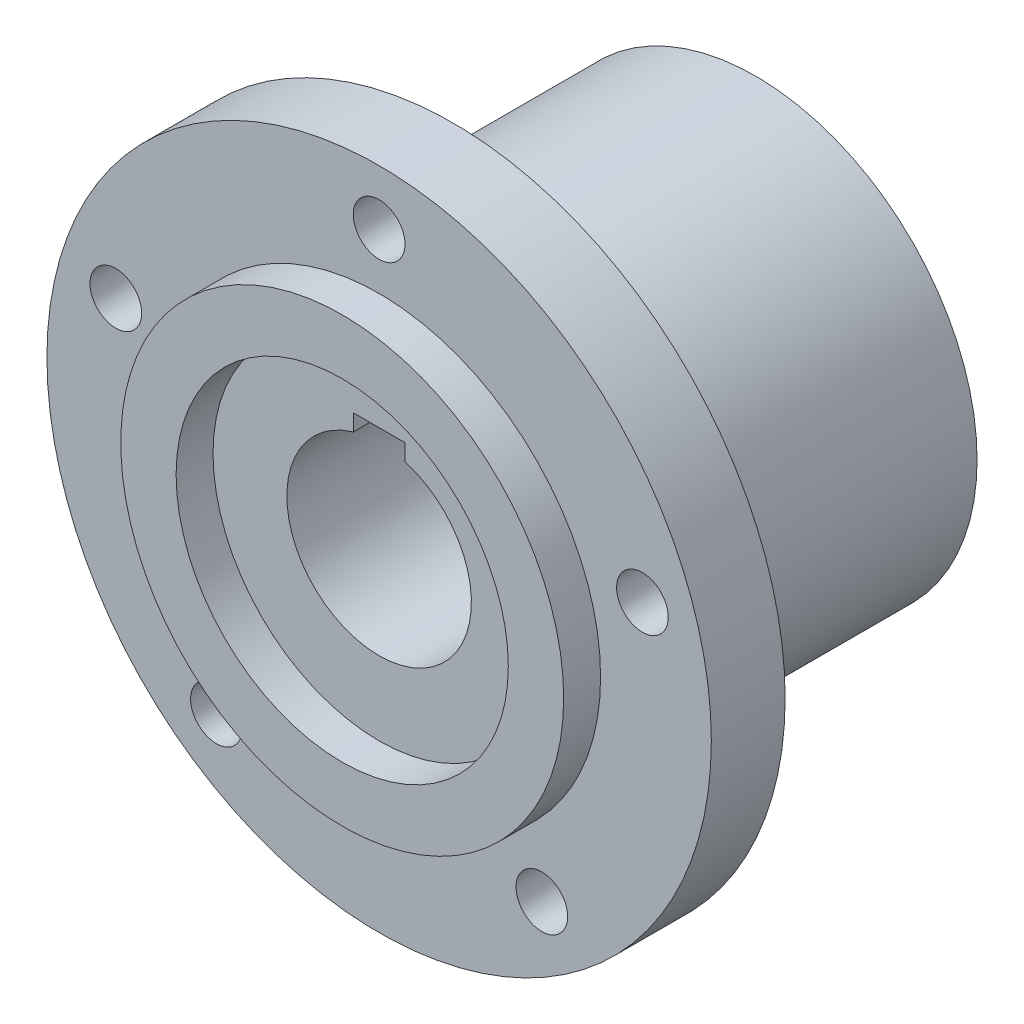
ISO-10303-21;
HEADER;
FILE_DESCRIPTION(('STEP AP214'),'2;1');
FILE_NAME('part.step','',(''),(''),'','','');
FILE_SCHEMA(('AUTOMOTIVE_DESIGN { 1 0 10303 214 1 1 1 1 }'));
ENDSEC;
DATA;
#1=APPLICATION_CONTEXT('core data for automotive mechanical design processes');
#2=APPLICATION_PROTOCOL_DEFINITION('international standard','automotive_design',2000,#1);
#3=PRODUCT_CONTEXT('',#1,'mechanical');
#4=PRODUCT('Part','Part','',(#3));
#5=PRODUCT_RELATED_PRODUCT_CATEGORY('part','',(#4));
#6=PRODUCT_DEFINITION_FORMATION('','',#4);
#7=PRODUCT_DEFINITION_CONTEXT('part definition',#1,'design');
#8=PRODUCT_DEFINITION('design','',#6,#7);
#9=PRODUCT_DEFINITION_SHAPE('','',#8);
#10=(LENGTH_UNIT() NAMED_UNIT(*) SI_UNIT(.MILLI.,.METRE.));
#11=(NAMED_UNIT(*) PLANE_ANGLE_UNIT() SI_UNIT($,.RADIAN.));
#12=(NAMED_UNIT(*) SI_UNIT($,.STERADIAN.) SOLID_ANGLE_UNIT());
#13=UNCERTAINTY_MEASURE_WITH_UNIT(LENGTH_MEASURE(1.E-05),#10,'distance_accuracy_value','');
#14=(GEOMETRIC_REPRESENTATION_CONTEXT(3) GLOBAL_UNCERTAINTY_ASSIGNED_CONTEXT((#13)) GLOBAL_UNIT_ASSIGNED_CONTEXT((#10,
#11,#12)) REPRESENTATION_CONTEXT('',''));
#15=CARTESIAN_POINT('',(0.,0.,0.));
#16=DIRECTION('',(0.,0.,1.));
#17=DIRECTION('',(1.,0.,0.));
#18=AXIS2_PLACEMENT_3D('',#15,#16,#17);
#19=CARTESIAN_POINT('',(0.,0.,51.));
#20=DIRECTION('',(0.,0.,1.));
#21=DIRECTION('',(1.,0.,0.));
#22=AXIS2_PLACEMENT_3D('',#19,#20,#21);
#23=PLANE('',#22);
#24=CARTESIAN_POINT('',(-71.3292387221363,23.1762745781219,51.));
#25=DIRECTION('',(0.,0.,1.));
#26=DIRECTION('',(1.,0.,0.));
#27=AXIS2_PLACEMENT_3D('',#24,#25,#26);
#28=CIRCLE('',#27,6.99999999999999);
#29=CARTESIAN_POINT('',(-64.3292387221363,23.1762745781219,51.));
#30=VERTEX_POINT('',#29);
#31=EDGE_CURVE('E133',#30,#30,#28,.T.);
#32=ORIENTED_EDGE('',*,*,#31,.F.);
#33=EDGE_LOOP('',(#32));
#34=FACE_BOUND('',#33,.T.);
#35=CARTESIAN_POINT('',(-44.0838939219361,-60.6762745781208,51.));
#36=DIRECTION('',(0.,0.,1.));
#37=DIRECTION('',(1.,0.,0.));
#38=AXIS2_PLACEMENT_3D('',#35,#36,#37);
#39=CIRCLE('',#38,6.99999999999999);
#40=CARTESIAN_POINT('',(-37.0838939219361,-60.6762745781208,51.));
#41=VERTEX_POINT('',#40);
#42=EDGE_CURVE('E130',#41,#41,#39,.T.);
#43=ORIENTED_EDGE('',*,*,#42,.F.);
#44=EDGE_LOOP('',(#43));
#45=FACE_BOUND('',#44,.T.);
#46=CARTESIAN_POINT('',(44.0838939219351,-60.6762745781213,51.));
#47=DIRECTION('',(0.,0.,1.));
#48=DIRECTION('',(1.,0.,0.));
#49=AXIS2_PLACEMENT_3D('',#46,#47,#48);
#50=CIRCLE('',#49,6.99999999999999);
#51=CARTESIAN_POINT('',(51.0838939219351,-60.6762745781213,51.));
#52=VERTEX_POINT('',#51);
#53=EDGE_CURVE('E127',#52,#52,#50,.T.);
#54=ORIENTED_EDGE('',*,*,#53,.F.);
#55=EDGE_LOOP('',(#54));
#56=FACE_BOUND('',#55,.T.);
#57=CARTESIAN_POINT('',(71.3292387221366,23.1762745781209,51.0000000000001));
#58=DIRECTION('',(0.,0.,1.));
#59=DIRECTION('',(1.,0.,0.));
#60=AXIS2_PLACEMENT_3D('',#57,#58,#59);
#61=CIRCLE('',#60,6.99999999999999);
#62=CARTESIAN_POINT('',(78.3292387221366,23.1762745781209,51.0000000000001));
#63=VERTEX_POINT('',#62);
#64=EDGE_CURVE('E123',#63,#63,#61,.T.);
#65=ORIENTED_EDGE('',*,*,#64,.F.);
#66=EDGE_LOOP('',(#65));
#67=FACE_BOUND('',#66,.T.);
#68=CARTESIAN_POINT('',(0.,75.0000000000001,51.));
#69=DIRECTION('',(0.,0.,1.));
#70=DIRECTION('',(1.,0.,0.));
#71=AXIS2_PLACEMENT_3D('',#68,#69,#70);
#72=CIRCLE('',#71,6.99999999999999);
#73=CARTESIAN_POINT('',(6.99999999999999,75.0000000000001,51.));
#74=VERTEX_POINT('',#73);
#75=EDGE_CURVE('E119',#74,#74,#72,.T.);
#76=ORIENTED_EDGE('',*,*,#75,.F.);
#77=EDGE_LOOP('',(#76));
#78=FACE_BOUND('',#77,.T.);
#79=CARTESIAN_POINT('',(0.,0.,51.));
#80=DIRECTION('',(0.,0.,1.));
#81=DIRECTION('',(1.,0.,0.));
#82=AXIS2_PLACEMENT_3D('',#79,#80,#81);
#83=CIRCLE('',#82,90.);
#84=CARTESIAN_POINT('',(90.0000000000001,0.,51.));
#85=VERTEX_POINT('',#84);
#86=EDGE_CURVE('E118',#85,#85,#83,.T.);
#87=ORIENTED_EDGE('',*,*,#86,.T.);
#88=EDGE_LOOP('',(#87));
#89=FACE_BOUND('',#88,.T.);
#90=CARTESIAN_POINT('',(0.,0.,51.));
#91=DIRECTION('',(0.,0.,1.));
#92=DIRECTION('',(1.,0.,0.));
#93=AXIS2_PLACEMENT_3D('',#90,#91,#92);
#94=CIRCLE('',#93,60.);
#95=CARTESIAN_POINT('',(60.,0.,51.));
#96=VERTEX_POINT('',#95);
#97=EDGE_CURVE('E144',#96,#96,#94,.T.);
#98=ORIENTED_EDGE('',*,*,#97,.F.);
#99=EDGE_LOOP('',(#98));
#100=FACE_BOUND('',#99,.T.);
#101=ADVANCED_FACE('F34',(#34,#45,#56,#67,#78,#89,#100),#23,.T.);
#102=CARTESIAN_POINT('',(0.,0.,51.));
#103=DIRECTION('',(0.,0.,-1.));
#104=DIRECTION('',(-1.,0.,0.));
#105=AXIS2_PLACEMENT_3D('',#102,#103,#104);
#106=CYLINDRICAL_SURFACE('',#105,60.);
#107=CARTESIAN_POINT('',(0.,0.,-51.));
#108=DIRECTION('',(0.,0.,1.));
#109=DIRECTION('',(1.,0.,0.));
#110=AXIS2_PLACEMENT_3D('',#107,#108,#109);
#111=CIRCLE('',#110,60.);
#112=CARTESIAN_POINT('',(60.0000000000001,0.,-51.));
#113=VERTEX_POINT('',#112);
#114=EDGE_CURVE('E108',#113,#113,#111,.T.);
#115=ORIENTED_EDGE('',*,*,#114,.T.);
#116=EDGE_LOOP('',(#115));
#117=FACE_BOUND('',#116,.T.);
#118=CARTESIAN_POINT('',(0.,0.,31.));
#119=DIRECTION('',(0.,0.,1.));
#120=DIRECTION('',(1.,0.,0.));
#121=AXIS2_PLACEMENT_3D('',#118,#119,#120);
#122=CIRCLE('',#121,60.);
#123=CARTESIAN_POINT('',(60.,0.,31.));
#124=VERTEX_POINT('',#123);
#125=EDGE_CURVE('E42',#124,#124,#122,.T.);
#126=ORIENTED_EDGE('',*,*,#125,.F.);
#127=EDGE_LOOP('',(#126));
#128=FACE_BOUND('',#127,.T.);
#129=ADVANCED_FACE('F36',(#117,#128),#106,.T.);
#130=CARTESIAN_POINT('',(0.,0.,51.));
#131=DIRECTION('',(0.,0.,1.));
#132=DIRECTION('',(1.,0.,0.));
#133=AXIS2_PLACEMENT_3D('',#130,#131,#132);
#134=CIRCLE('',#133,45.);
#135=CARTESIAN_POINT('',(45.,0.,51.));
#136=VERTEX_POINT('',#135);
#137=EDGE_CURVE('E12',#136,#136,#134,.F.);
#138=ORIENTED_EDGE('',*,*,#137,.F.);
#139=EDGE_LOOP('',(#138));
#140=FACE_BOUND('',#139,.T.);
#141=DIRECTION('',(0.,1.,0.));
#142=VECTOR('',#141,1.);
#143=CARTESIAN_POINT('',(7.00000000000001,28.5,51.));
#144=LINE('',#143,#142);
#145=CARTESIAN_POINT('',(7.00000000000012,24.,51.));
#146=VERTEX_POINT('',#145);
#147=CARTESIAN_POINT('',(7.00000000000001,28.5,51.));
#148=VERTEX_POINT('',#147);
#149=EDGE_CURVE('E49',#146,#148,#144,.T.);
#150=ORIENTED_EDGE('',*,*,#149,.F.);
#151=CARTESIAN_POINT('',(0.,0.,51.));
#152=DIRECTION('',(0.,0.,1.));
#153=DIRECTION('',(1.,0.,0.));
#154=AXIS2_PLACEMENT_3D('',#151,#152,#153);
#155=CIRCLE('',#154,25.);
#156=CARTESIAN_POINT('',(-6.9999999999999,24.,51.));
#157=VERTEX_POINT('',#156);
#158=EDGE_CURVE('E92',#157,#146,#155,.T.);
#159=ORIENTED_EDGE('',*,*,#158,.F.);
#160=DIRECTION('',(0.,-1.,0.));
#161=VECTOR('',#160,1.);
#162=CARTESIAN_POINT('',(-7.00000000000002,28.5000000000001,51.));
#163=LINE('',#162,#161);
#164=CARTESIAN_POINT('',(-7.00000000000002,28.5000000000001,51.));
#165=VERTEX_POINT('',#164);
#166=EDGE_CURVE('E77',#165,#157,#163,.T.);
#167=ORIENTED_EDGE('',*,*,#166,.F.);
#168=DIRECTION('',(-1.,0.,0.));
#169=VECTOR('',#168,1.);
#170=CARTESIAN_POINT('',(7.00000000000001,28.5,51.));
#171=LINE('',#170,#169);
#172=EDGE_CURVE('E86',#148,#165,#171,.T.);
#173=ORIENTED_EDGE('',*,*,#172,.F.);
#174=EDGE_LOOP('',(#150,#159,#167,#173));
#175=FACE_BOUND('',#174,.T.);
#176=ADVANCED_FACE('F90',(#140,#175),#23,.T.);
#177=CARTESIAN_POINT('',(0.,0.,-51.));
#178=DIRECTION('',(0.,0.,1.));
#179=DIRECTION('',(1.,0.,0.));
#180=AXIS2_PLACEMENT_3D('',#177,#178,#179);
#181=PLANE('',#180);
#182=CARTESIAN_POINT('',(0.,0.,-51.));
#183=DIRECTION('',(0.,0.,1.));
#184=DIRECTION('',(1.,0.,0.));
#185=AXIS2_PLACEMENT_3D('',#182,#183,#184);
#186=CIRCLE('',#185,25.);
#187=CARTESIAN_POINT('',(-6.99999999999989,24.0000000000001,-51.));
#188=VERTEX_POINT('',#187);
#189=CARTESIAN_POINT('',(7.00000000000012,24.,-51.));
#190=VERTEX_POINT('',#189);
#191=EDGE_CURVE('E103',#188,#190,#186,.T.);
#192=ORIENTED_EDGE('',*,*,#191,.T.);
#193=DIRECTION('',(0.,1.,0.));
#194=VECTOR('',#193,1.);
#195=CARTESIAN_POINT('',(7.00000000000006,28.5,-51.));
#196=LINE('',#195,#194);
#197=CARTESIAN_POINT('',(7.00000000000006,28.5,-51.));
#198=VERTEX_POINT('',#197);
#199=EDGE_CURVE('E94',#190,#198,#196,.T.);
#200=ORIENTED_EDGE('',*,*,#199,.T.);
#201=DIRECTION('',(-1.,0.,0.));
#202=VECTOR('',#201,1.);
#203=CARTESIAN_POINT('',(7.00000000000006,28.5,-51.));
#204=LINE('',#203,#202);
#205=CARTESIAN_POINT('',(-6.99999999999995,28.5000000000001,-51.));
#206=VERTEX_POINT('',#205);
#207=EDGE_CURVE('E100',#198,#206,#204,.T.);
#208=ORIENTED_EDGE('',*,*,#207,.T.);
#209=DIRECTION('',(0.,-1.,0.));
#210=VECTOR('',#209,1.);
#211=CARTESIAN_POINT('',(-6.99999999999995,28.5000000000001,-51.));
#212=LINE('',#211,#210);
#213=EDGE_CURVE('E57',#206,#188,#212,.T.);
#214=ORIENTED_EDGE('',*,*,#213,.T.);
#215=EDGE_LOOP('',(#192,#200,#208,#214));
#216=FACE_BOUND('',#215,.T.);
#217=ORIENTED_EDGE('',*,*,#114,.F.);
#218=EDGE_LOOP('',(#217));
#219=FACE_BOUND('',#218,.T.);
#220=ADVANCED_FACE('F185',(#216,#219),#181,.F.);
#221=CARTESIAN_POINT('',(7.00000000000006,28.5,-51.));
#222=DIRECTION('',(1.,0.,0.));
#223=DIRECTION('',(0.,1.,0.));
#224=AXIS2_PLACEMENT_3D('',#221,#222,#223);
#225=PLANE('',#224);
#226=ORIENTED_EDGE('',*,*,#149,.T.);
#227=DIRECTION('',(0.,0.,1.));
#228=VECTOR('',#227,1.);
#229=CARTESIAN_POINT('',(7.00000000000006,28.5,-51.));
#230=LINE('',#229,#228);
#231=EDGE_CURVE('E83',#198,#148,#230,.T.);
#232=ORIENTED_EDGE('',*,*,#231,.F.);
#233=ORIENTED_EDGE('',*,*,#199,.F.);
#234=DIRECTION('',(0.,0.,1.));
#235=VECTOR('',#234,1.);
#236=CARTESIAN_POINT('',(7.00000000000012,24.,-51.));
#237=LINE('',#236,#235);
#238=EDGE_CURVE('E106',#190,#146,#237,.T.);
#239=ORIENTED_EDGE('',*,*,#238,.T.);
#240=EDGE_LOOP('',(#226,#232,#233,#239));
#241=FACE_BOUND('',#240,.T.);
#242=ADVANCED_FACE('F190',(#241),#225,.F.);
#243=CARTESIAN_POINT('',(0.,0.,-51.));
#244=DIRECTION('',(0.,0.,1.));
#245=DIRECTION('',(1.,0.,0.));
#246=AXIS2_PLACEMENT_3D('',#243,#244,#245);
#247=CYLINDRICAL_SURFACE('',#246,25.);
#248=ORIENTED_EDGE('',*,*,#158,.T.);
#249=ORIENTED_EDGE('',*,*,#238,.F.);
#250=ORIENTED_EDGE('',*,*,#191,.F.);
#251=DIRECTION('',(0.,0.,1.));
#252=VECTOR('',#251,1.);
#253=CARTESIAN_POINT('',(-6.99999999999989,24.0000000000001,-51.));
#254=LINE('',#253,#252);
#255=EDGE_CURVE('E82',#188,#157,#254,.T.);
#256=ORIENTED_EDGE('',*,*,#255,.T.);
#257=EDGE_LOOP('',(#248,#249,#250,#256));
#258=FACE_BOUND('',#257,.T.);
#259=ADVANCED_FACE('F308',(#258),#247,.F.);
#260=CARTESIAN_POINT('',(-6.99999999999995,28.5000000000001,-51.));
#261=DIRECTION('',(-1.,0.,0.));
#262=DIRECTION('',(0.,-1.,0.));
#263=AXIS2_PLACEMENT_3D('',#260,#261,#262);
#264=PLANE('',#263);
#265=ORIENTED_EDGE('',*,*,#166,.T.);
#266=ORIENTED_EDGE('',*,*,#255,.F.);
#267=ORIENTED_EDGE('',*,*,#213,.F.);
#268=DIRECTION('',(0.,0.,1.));
#269=VECTOR('',#268,1.);
#270=CARTESIAN_POINT('',(-6.99999999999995,28.5000000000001,-51.));
#271=LINE('',#270,#269);
#272=EDGE_CURVE('E73',#206,#165,#271,.T.);
#273=ORIENTED_EDGE('',*,*,#272,.T.);
#274=EDGE_LOOP('',(#265,#266,#267,#273));
#275=FACE_BOUND('',#274,.T.);
#276=ADVANCED_FACE('F75',(#275),#264,.F.);
#277=CARTESIAN_POINT('',(7.00000000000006,28.5,-51.));
#278=DIRECTION('',(0.,1.,0.));
#279=DIRECTION('',(0.,0.,1.));
#280=AXIS2_PLACEMENT_3D('',#277,#278,#279);
#281=PLANE('',#280);
#282=ORIENTED_EDGE('',*,*,#172,.T.);
#283=ORIENTED_EDGE('',*,*,#272,.F.);
#284=ORIENTED_EDGE('',*,*,#207,.F.);
#285=ORIENTED_EDGE('',*,*,#231,.T.);
#286=EDGE_LOOP('',(#282,#283,#284,#285));
#287=FACE_BOUND('',#286,.T.);
#288=ADVANCED_FACE('F87',(#287),#281,.F.);
#289=CARTESIAN_POINT('',(0.,0.,31.));
#290=DIRECTION('',(0.,0.,1.));
#291=DIRECTION('',(1.,0.,0.));
#292=AXIS2_PLACEMENT_3D('',#289,#290,#291);
#293=CYLINDRICAL_SURFACE('',#292,90.);
#294=CARTESIAN_POINT('',(0.,0.,31.));
#295=DIRECTION('',(0.,0.,1.));
#296=DIRECTION('',(1.,0.,0.));
#297=AXIS2_PLACEMENT_3D('',#294,#295,#296);
#298=CIRCLE('',#297,90.);
#299=CARTESIAN_POINT('',(90.0000000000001,0.,31.));
#300=VERTEX_POINT('',#299);
#301=EDGE_CURVE('E156',#300,#300,#298,.T.);
#302=ORIENTED_EDGE('',*,*,#301,.T.);
#303=EDGE_LOOP('',(#302));
#304=FACE_BOUND('',#303,.T.);
#305=ORIENTED_EDGE('',*,*,#86,.F.);
#306=EDGE_LOOP('',(#305));
#307=FACE_BOUND('',#306,.T.);
#308=ADVANCED_FACE('F160',(#304,#307),#293,.T.);
#309=CARTESIAN_POINT('',(0.,0.,31.));
#310=DIRECTION('',(0.,0.,1.));
#311=DIRECTION('',(1.,0.,0.));
#312=AXIS2_PLACEMENT_3D('',#309,#310,#311);
#313=PLANE('',#312);
#314=CARTESIAN_POINT('',(-71.3292387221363,23.1762745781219,31.));
#315=DIRECTION('',(0.,0.,1.));
#316=DIRECTION('',(1.,0.,0.));
#317=AXIS2_PLACEMENT_3D('',#314,#315,#316);
#318=CIRCLE('',#317,6.99999999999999);
#319=CARTESIAN_POINT('',(-64.3292387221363,23.1762745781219,31.));
#320=VERTEX_POINT('',#319);
#321=EDGE_CURVE('E131',#320,#320,#318,.T.);
#322=ORIENTED_EDGE('',*,*,#321,.T.);
#323=EDGE_LOOP('',(#322));
#324=FACE_BOUND('',#323,.T.);
#325=CARTESIAN_POINT('',(-44.0838939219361,-60.6762745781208,31.0000000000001));
#326=DIRECTION('',(0.,0.,1.));
#327=DIRECTION('',(1.,0.,0.));
#328=AXIS2_PLACEMENT_3D('',#325,#326,#327);
#329=CIRCLE('',#328,6.99999999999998);
#330=CARTESIAN_POINT('',(-37.0838939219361,-60.6762745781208,31.0000000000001));
#331=VERTEX_POINT('',#330);
#332=EDGE_CURVE('E128',#331,#331,#329,.T.);
#333=ORIENTED_EDGE('',*,*,#332,.T.);
#334=EDGE_LOOP('',(#333));
#335=FACE_BOUND('',#334,.T.);
#336=CARTESIAN_POINT('',(44.0838939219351,-60.6762745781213,31.));
#337=DIRECTION('',(0.,0.,1.));
#338=DIRECTION('',(1.,0.,0.));
#339=AXIS2_PLACEMENT_3D('',#336,#337,#338);
#340=CIRCLE('',#339,6.99999999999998);
#341=CARTESIAN_POINT('',(51.0838939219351,-60.6762745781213,31.));
#342=VERTEX_POINT('',#341);
#343=EDGE_CURVE('E124',#342,#342,#340,.T.);
#344=ORIENTED_EDGE('',*,*,#343,.T.);
#345=EDGE_LOOP('',(#344));
#346=FACE_BOUND('',#345,.T.);
#347=CARTESIAN_POINT('',(71.3292387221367,23.1762745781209,31.));
#348=DIRECTION('',(0.,0.,1.));
#349=DIRECTION('',(1.,0.,0.));
#350=AXIS2_PLACEMENT_3D('',#347,#348,#349);
#351=CIRCLE('',#350,6.99999999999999);
#352=CARTESIAN_POINT('',(78.3292387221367,23.1762745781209,31.));
#353=VERTEX_POINT('',#352);
#354=EDGE_CURVE('E120',#353,#353,#351,.T.);
#355=ORIENTED_EDGE('',*,*,#354,.T.);
#356=EDGE_LOOP('',(#355));
#357=FACE_BOUND('',#356,.T.);
#358=CARTESIAN_POINT('',(0.,75.0000000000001,31.));
#359=DIRECTION('',(0.,0.,1.));
#360=DIRECTION('',(1.,0.,0.));
#361=AXIS2_PLACEMENT_3D('',#358,#359,#360);
#362=CIRCLE('',#361,6.99999999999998);
#363=CARTESIAN_POINT('',(6.99999999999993,75.0000000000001,31.));
#364=VERTEX_POINT('',#363);
#365=EDGE_CURVE('E115',#364,#364,#362,.T.);
#366=ORIENTED_EDGE('',*,*,#365,.T.);
#367=EDGE_LOOP('',(#366));
#368=FACE_BOUND('',#367,.T.);
#369=ORIENTED_EDGE('',*,*,#125,.T.);
#370=EDGE_LOOP('',(#369));
#371=FACE_BOUND('',#370,.T.);
#372=ORIENTED_EDGE('',*,*,#301,.F.);
#373=EDGE_LOOP('',(#372));
#374=FACE_BOUND('',#373,.T.);
#375=ADVANCED_FACE('F163',(#324,#335,#346,#357,#368,#371,#374),#313,.F.);
#376=CARTESIAN_POINT('',(0.,75.0000000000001,51.));
#377=DIRECTION('',(0.,0.,1.));
#378=DIRECTION('',(1.,0.,0.));
#379=AXIS2_PLACEMENT_3D('',#376,#377,#378);
#380=CYLINDRICAL_SURFACE('',#379,6.99999999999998);
#381=ORIENTED_EDGE('',*,*,#75,.T.);
#382=EDGE_LOOP('',(#381));
#383=FACE_BOUND('',#382,.T.);
#384=ORIENTED_EDGE('',*,*,#365,.F.);
#385=EDGE_LOOP('',(#384));
#386=FACE_BOUND('',#385,.T.);
#387=ADVANCED_FACE('F165',(#383,#386),#380,.F.);
#388=CARTESIAN_POINT('',(71.3292387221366,23.1762745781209,51.0000000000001));
#389=DIRECTION('',(0.,0.,1.));
#390=DIRECTION('',(1.,0.,0.));
#391=AXIS2_PLACEMENT_3D('',#388,#389,#390);
#392=CYLINDRICAL_SURFACE('',#391,6.99999999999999);
#393=ORIENTED_EDGE('',*,*,#64,.T.);
#394=EDGE_LOOP('',(#393));
#395=FACE_BOUND('',#394,.T.);
#396=ORIENTED_EDGE('',*,*,#354,.F.);
#397=EDGE_LOOP('',(#396));
#398=FACE_BOUND('',#397,.T.);
#399=ADVANCED_FACE('F171',(#395,#398),#392,.F.);
#400=CARTESIAN_POINT('',(44.0838939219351,-60.6762745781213,51.));
#401=DIRECTION('',(0.,0.,1.));
#402=DIRECTION('',(1.,0.,0.));
#403=AXIS2_PLACEMENT_3D('',#400,#401,#402);
#404=CYLINDRICAL_SURFACE('',#403,6.99999999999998);
#405=ORIENTED_EDGE('',*,*,#53,.T.);
#406=EDGE_LOOP('',(#405));
#407=FACE_BOUND('',#406,.T.);
#408=ORIENTED_EDGE('',*,*,#343,.F.);
#409=EDGE_LOOP('',(#408));
#410=FACE_BOUND('',#409,.T.);
#411=ADVANCED_FACE('F216',(#407,#410),#404,.F.);
#412=CARTESIAN_POINT('',(-44.0838939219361,-60.6762745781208,51.));
#413=DIRECTION('',(0.,0.,1.));
#414=DIRECTION('',(1.,0.,0.));
#415=AXIS2_PLACEMENT_3D('',#412,#413,#414);
#416=CYLINDRICAL_SURFACE('',#415,6.99999999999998);
#417=ORIENTED_EDGE('',*,*,#42,.T.);
#418=EDGE_LOOP('',(#417));
#419=FACE_BOUND('',#418,.T.);
#420=ORIENTED_EDGE('',*,*,#332,.F.);
#421=EDGE_LOOP('',(#420));
#422=FACE_BOUND('',#421,.T.);
#423=ADVANCED_FACE('F213',(#419,#422),#416,.F.);
#424=CARTESIAN_POINT('',(-71.3292387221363,23.1762745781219,51.));
#425=DIRECTION('',(0.,0.,1.));
#426=DIRECTION('',(1.,0.,0.));
#427=AXIS2_PLACEMENT_3D('',#424,#425,#426);
#428=CYLINDRICAL_SURFACE('',#427,6.99999999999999);
#429=ORIENTED_EDGE('',*,*,#31,.T.);
#430=EDGE_LOOP('',(#429));
#431=FACE_BOUND('',#430,.T.);
#432=ORIENTED_EDGE('',*,*,#321,.F.);
#433=EDGE_LOOP('',(#432));
#434=FACE_BOUND('',#433,.T.);
#435=ADVANCED_FACE('F208',(#431,#434),#428,.F.);
#436=CARTESIAN_POINT('',(0.,0.,61.0000000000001));
#437=DIRECTION('',(0.,0.,1.));
#438=DIRECTION('',(1.,0.,0.));
#439=AXIS2_PLACEMENT_3D('',#436,#437,#438);
#440=PLANE('',#439);
#441=CARTESIAN_POINT('',(0.,0.,61.0000000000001));
#442=DIRECTION('',(0.,0.,1.));
#443=DIRECTION('',(1.,0.,0.));
#444=AXIS2_PLACEMENT_3D('',#441,#442,#443);
#445=CIRCLE('',#444,60.);
#446=CARTESIAN_POINT('',(60.,0.,61.0000000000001));
#447=VERTEX_POINT('',#446);
#448=EDGE_CURVE('E139',#447,#447,#445,.T.);
#449=ORIENTED_EDGE('',*,*,#448,.T.);
#450=EDGE_LOOP('',(#449));
#451=FACE_BOUND('',#450,.T.);
#452=CARTESIAN_POINT('',(0.,0.,61.0000000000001));
#453=DIRECTION('',(0.,0.,1.));
#454=DIRECTION('',(1.,0.,0.));
#455=AXIS2_PLACEMENT_3D('',#452,#453,#454);
#456=CIRCLE('',#455,45.);
#457=CARTESIAN_POINT('',(45.,0.,61.0000000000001));
#458=VERTEX_POINT('',#457);
#459=EDGE_CURVE('E244',#458,#458,#456,.T.);
#460=ORIENTED_EDGE('',*,*,#459,.F.);
#461=EDGE_LOOP('',(#460));
#462=FACE_BOUND('',#461,.T.);
#463=ADVANCED_FACE('F202',(#451,#462),#440,.T.);
#464=CARTESIAN_POINT('',(0.,0.,61.0000000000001));
#465=DIRECTION('',(0.,0.,-1.));
#466=DIRECTION('',(-1.,0.,0.));
#467=AXIS2_PLACEMENT_3D('',#464,#465,#466);
#468=CYLINDRICAL_SURFACE('',#467,60.);
#469=ORIENTED_EDGE('',*,*,#448,.F.);
#470=EDGE_LOOP('',(#469));
#471=FACE_BOUND('',#470,.T.);
#472=ORIENTED_EDGE('',*,*,#97,.T.);
#473=EDGE_LOOP('',(#472));
#474=FACE_BOUND('',#473,.T.);
#475=ADVANCED_FACE('F196',(#471,#474),#468,.T.);
#476=CARTESIAN_POINT('',(0.,0.,61.0000000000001));
#477=DIRECTION('',(0.,0.,-1.));
#478=DIRECTION('',(-1.,0.,0.));
#479=AXIS2_PLACEMENT_3D('',#476,#477,#478);
#480=CYLINDRICAL_SURFACE('',#479,45.);
#481=ORIENTED_EDGE('',*,*,#459,.T.);
#482=EDGE_LOOP('',(#481));
#483=FACE_BOUND('',#482,.T.);
#484=ORIENTED_EDGE('',*,*,#137,.T.);
#485=EDGE_LOOP('',(#484));
#486=FACE_BOUND('',#485,.T.);
#487=ADVANCED_FACE('F194',(#483,#486),#480,.F.);
#488=CLOSED_SHELL('',(#101,#129,#176,#220,#242,#259,#276,#288,#308,#375,#387,#399,#411,#423,
#435,#463,#475,#487));
#489=MANIFOLD_SOLID_BREP('B2',#488);
#490=ADVANCED_BREP_SHAPE_REPRESENTATION('',(#18,#489),#14);
#491=SHAPE_DEFINITION_REPRESENTATION(#9,#490);
ENDSEC;
END-ISO-10303-21;
